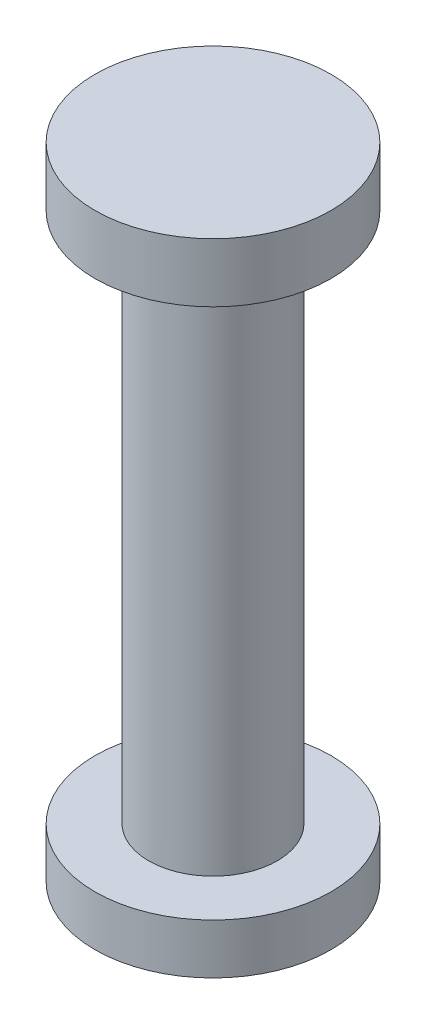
ISO-10303-21;
HEADER;
FILE_DESCRIPTION(('STEP AP214'),'2;1');
FILE_NAME('part.step','',(''),(''),'','','');
FILE_SCHEMA(('AUTOMOTIVE_DESIGN { 1 0 10303 214 1 1 1 1 }'));
ENDSEC;
DATA;
#1=APPLICATION_CONTEXT('core data for automotive mechanical design processes');
#2=APPLICATION_PROTOCOL_DEFINITION('international standard','automotive_design',2000,#1);
#3=PRODUCT_CONTEXT('',#1,'mechanical');
#4=PRODUCT('Part','Part','',(#3));
#5=PRODUCT_RELATED_PRODUCT_CATEGORY('part','',(#4));
#6=PRODUCT_DEFINITION_FORMATION('','',#4);
#7=PRODUCT_DEFINITION_CONTEXT('part definition',#1,'design');
#8=PRODUCT_DEFINITION('design','',#6,#7);
#9=PRODUCT_DEFINITION_SHAPE('','',#8);
#10=(LENGTH_UNIT() NAMED_UNIT(*) SI_UNIT(.MILLI.,.METRE.));
#11=(NAMED_UNIT(*) PLANE_ANGLE_UNIT() SI_UNIT($,.RADIAN.));
#12=(NAMED_UNIT(*) SI_UNIT($,.STERADIAN.) SOLID_ANGLE_UNIT());
#13=UNCERTAINTY_MEASURE_WITH_UNIT(LENGTH_MEASURE(1.E-05),#10,'distance_accuracy_value','');
#14=(GEOMETRIC_REPRESENTATION_CONTEXT(3) GLOBAL_UNCERTAINTY_ASSIGNED_CONTEXT((#13)) GLOBAL_UNIT_ASSIGNED_CONTEXT((#10,
#11,#12)) REPRESENTATION_CONTEXT('',''));
#15=CARTESIAN_POINT('',(0.,0.,0.));
#16=DIRECTION('',(0.,0.,1.));
#17=DIRECTION('',(1.,0.,0.));
#18=AXIS2_PLACEMENT_3D('',#15,#16,#17);
#19=CARTESIAN_POINT('',(0.,19.4,-88.));
#20=DIRECTION('',(0.,1.,0.));
#21=DIRECTION('',(0.,0.,1.));
#22=AXIS2_PLACEMENT_3D('',#19,#20,#21);
#23=CYLINDRICAL_SURFACE('',#22,2.18);
#24=CARTESIAN_POINT('',(0.,37.5,-88.));
#25=DIRECTION('',(0.,-1.,0.));
#26=DIRECTION('',(0.,0.,-1.));
#27=AXIS2_PLACEMENT_3D('',#24,#25,#26);
#28=CIRCLE('',#27,2.18);
#29=CARTESIAN_POINT('',(0.,37.5,-90.18));
#30=VERTEX_POINT('',#29);
#31=EDGE_CURVE('E9',#30,#30,#28,.F.);
#32=ORIENTED_EDGE('',*,*,#31,.F.);
#33=EDGE_LOOP('',(#32));
#34=FACE_BOUND('',#33,.T.);
#35=CARTESIAN_POINT('',(0.,19.5,-88.));
#36=DIRECTION('',(0.,1.,0.));
#37=DIRECTION('',(0.,0.,1.));
#38=AXIS2_PLACEMENT_3D('',#35,#36,#37);
#39=CIRCLE('',#38,2.18);
#40=CARTESIAN_POINT('',(0.,19.5,-85.82));
#41=VERTEX_POINT('',#40);
#42=EDGE_CURVE('E20',#41,#41,#39,.F.);
#43=ORIENTED_EDGE('',*,*,#42,.F.);
#44=EDGE_LOOP('',(#43));
#45=FACE_BOUND('',#44,.T.);
#46=ADVANCED_FACE('F14',(#34,#45),#23,.T.);
#47=CARTESIAN_POINT('',(0.,19.5,-88.));
#48=DIRECTION('',(0.,1.,0.));
#49=DIRECTION('',(0.,0.,1.));
#50=AXIS2_PLACEMENT_3D('',#47,#48,#49);
#51=PLANE('',#50);
#52=ORIENTED_EDGE('',*,*,#42,.T.);
#53=EDGE_LOOP('',(#52));
#54=FACE_BOUND('',#53,.T.);
#55=CARTESIAN_POINT('',(0.,19.5,-88.));
#56=DIRECTION('',(0.,-1.,0.));
#57=DIRECTION('',(0.,0.,-1.));
#58=AXIS2_PLACEMENT_3D('',#55,#56,#57);
#59=CIRCLE('',#58,4.);
#60=CARTESIAN_POINT('',(0.,19.5,-92.));
#61=VERTEX_POINT('',#60);
#62=EDGE_CURVE('E24',#61,#61,#59,.T.);
#63=ORIENTED_EDGE('',*,*,#62,.F.);
#64=EDGE_LOOP('',(#63));
#65=FACE_BOUND('',#64,.T.);
#66=ADVANCED_FACE('F60',(#54,#65),#51,.T.);
#67=CARTESIAN_POINT('',(0.,17.8,-88.));
#68=DIRECTION('',(0.,-1.,0.));
#69=DIRECTION('',(0.,0.,-1.));
#70=AXIS2_PLACEMENT_3D('',#67,#68,#69);
#71=PLANE('',#70);
#72=CARTESIAN_POINT('',(0.,17.8,-88.));
#73=DIRECTION('',(0.,1.,0.));
#74=DIRECTION('',(0.,0.,1.));
#75=AXIS2_PLACEMENT_3D('',#72,#73,#74);
#76=CIRCLE('',#75,4.);
#77=CARTESIAN_POINT('',(0.,17.8,-84.));
#78=VERTEX_POINT('',#77);
#79=EDGE_CURVE('E29',#78,#78,#76,.T.);
#80=ORIENTED_EDGE('',*,*,#79,.F.);
#81=EDGE_LOOP('',(#80));
#82=FACE_BOUND('',#81,.T.);
#83=ADVANCED_FACE('F62',(#82),#71,.T.);
#84=CARTESIAN_POINT('',(0.,17.8,-88.));
#85=DIRECTION('',(0.,1.,0.));
#86=DIRECTION('',(0.,0.,1.));
#87=AXIS2_PLACEMENT_3D('',#84,#85,#86);
#88=CYLINDRICAL_SURFACE('',#87,4.);
#89=ORIENTED_EDGE('',*,*,#62,.T.);
#90=EDGE_LOOP('',(#89));
#91=FACE_BOUND('',#90,.T.);
#92=ORIENTED_EDGE('',*,*,#79,.T.);
#93=EDGE_LOOP('',(#92));
#94=FACE_BOUND('',#93,.T.);
#95=ADVANCED_FACE('F52',(#91,#94),#88,.T.);
#96=CARTESIAN_POINT('',(0.,39.5,-88.));
#97=DIRECTION('',(0.,1.,0.));
#98=DIRECTION('',(0.,0.,1.));
#99=AXIS2_PLACEMENT_3D('',#96,#97,#98);
#100=PLANE('',#99);
#101=CARTESIAN_POINT('',(0.,39.5,-88.));
#102=DIRECTION('',(0.,-1.,0.));
#103=DIRECTION('',(0.,0.,-1.));
#104=AXIS2_PLACEMENT_3D('',#101,#102,#103);
#105=CIRCLE('',#104,4.);
#106=CARTESIAN_POINT('',(0.,39.5,-92.));
#107=VERTEX_POINT('',#106);
#108=EDGE_CURVE('E31',#107,#107,#105,.T.);
#109=ORIENTED_EDGE('',*,*,#108,.F.);
#110=EDGE_LOOP('',(#109));
#111=FACE_BOUND('',#110,.T.);
#112=ADVANCED_FACE('F42',(#111),#100,.T.);
#113=CARTESIAN_POINT('',(0.,37.5,-88.));
#114=DIRECTION('',(0.,-1.,0.));
#115=DIRECTION('',(0.,0.,-1.));
#116=AXIS2_PLACEMENT_3D('',#113,#114,#115);
#117=PLANE('',#116);
#118=ORIENTED_EDGE('',*,*,#31,.T.);
#119=EDGE_LOOP('',(#118));
#120=FACE_BOUND('',#119,.T.);
#121=CARTESIAN_POINT('',(0.,37.5,-88.));
#122=DIRECTION('',(0.,1.,0.));
#123=DIRECTION('',(0.,0.,1.));
#124=AXIS2_PLACEMENT_3D('',#121,#122,#123);
#125=CIRCLE('',#124,4.);
#126=CARTESIAN_POINT('',(0.,37.5,-84.));
#127=VERTEX_POINT('',#126);
#128=EDGE_CURVE('E38',#127,#127,#125,.T.);
#129=ORIENTED_EDGE('',*,*,#128,.F.);
#130=EDGE_LOOP('',(#129));
#131=FACE_BOUND('',#130,.T.);
#132=ADVANCED_FACE('F45',(#120,#131),#117,.T.);
#133=CARTESIAN_POINT('',(0.,37.5,-88.));
#134=DIRECTION('',(0.,1.,0.));
#135=DIRECTION('',(0.,0.,1.));
#136=AXIS2_PLACEMENT_3D('',#133,#134,#135);
#137=CYLINDRICAL_SURFACE('',#136,4.);
#138=ORIENTED_EDGE('',*,*,#108,.T.);
#139=EDGE_LOOP('',(#138));
#140=FACE_BOUND('',#139,.T.);
#141=ORIENTED_EDGE('',*,*,#128,.T.);
#142=EDGE_LOOP('',(#141));
#143=FACE_BOUND('',#142,.T.);
#144=ADVANCED_FACE('F37',(#140,#143),#137,.T.);
#145=CLOSED_SHELL('',(#46,#66,#83,#95,#112,#132,#144));
#146=MANIFOLD_SOLID_BREP('B1',#145);
#147=ADVANCED_BREP_SHAPE_REPRESENTATION('',(#18,#146),#14);
#148=SHAPE_DEFINITION_REPRESENTATION(#9,#147);
ENDSEC;
END-ISO-10303-21;
